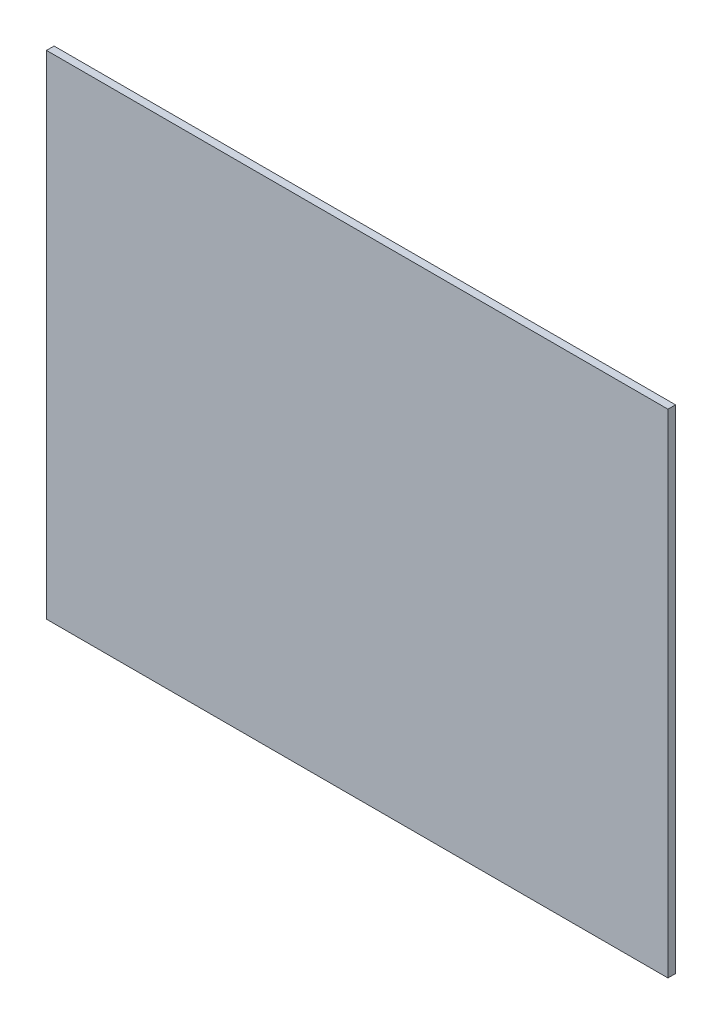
ISO-10303-21;
HEADER;
FILE_DESCRIPTION(('STEP AP214'),'2;1');
FILE_NAME('part.step','',(''),(''),'','','');
FILE_SCHEMA(('AUTOMOTIVE_DESIGN { 1 0 10303 214 1 1 1 1 }'));
ENDSEC;
DATA;
#1=APPLICATION_CONTEXT('core data for automotive mechanical design processes');
#2=APPLICATION_PROTOCOL_DEFINITION('international standard','automotive_design',2000,#1);
#3=PRODUCT_CONTEXT('',#1,'mechanical');
#4=PRODUCT('Part','Part','',(#3));
#5=PRODUCT_RELATED_PRODUCT_CATEGORY('part','',(#4));
#6=PRODUCT_DEFINITION_FORMATION('','',#4);
#7=PRODUCT_DEFINITION_CONTEXT('part definition',#1,'design');
#8=PRODUCT_DEFINITION('design','',#6,#7);
#9=PRODUCT_DEFINITION_SHAPE('','',#8);
#10=(LENGTH_UNIT() NAMED_UNIT(*) SI_UNIT(.MILLI.,.METRE.));
#11=(NAMED_UNIT(*) PLANE_ANGLE_UNIT() SI_UNIT($,.RADIAN.));
#12=(NAMED_UNIT(*) SI_UNIT($,.STERADIAN.) SOLID_ANGLE_UNIT());
#13=UNCERTAINTY_MEASURE_WITH_UNIT(LENGTH_MEASURE(1.E-05),#10,'distance_accuracy_value','');
#14=(GEOMETRIC_REPRESENTATION_CONTEXT(3) GLOBAL_UNCERTAINTY_ASSIGNED_CONTEXT((#13)) GLOBAL_UNIT_ASSIGNED_CONTEXT((#10,
#11,#12)) REPRESENTATION_CONTEXT('',''));
#15=CARTESIAN_POINT('',(0.,0.,0.));
#16=DIRECTION('',(0.,0.,1.));
#17=DIRECTION('',(1.,0.,0.));
#18=AXIS2_PLACEMENT_3D('',#15,#16,#17);
#19=CARTESIAN_POINT('',(520.7,-412.75,6.35));
#20=DIRECTION('',(-1.,0.,0.));
#21=DIRECTION('',(0.,0.,1.));
#22=AXIS2_PLACEMENT_3D('',#19,#20,#21);
#23=PLANE('',#22);
#24=DIRECTION('',(0.,1.,0.));
#25=VECTOR('',#24,1.);
#26=CARTESIAN_POINT('',(520.7,-412.75,-6.35));
#27=LINE('',#26,#25);
#28=CARTESIAN_POINT('',(520.7,-412.75,-6.35));
#29=VERTEX_POINT('',#28);
#30=CARTESIAN_POINT('',(520.7,412.75,-6.35));
#31=VERTEX_POINT('',#30);
#32=EDGE_CURVE('E93',#29,#31,#27,.T.);
#33=ORIENTED_EDGE('',*,*,#32,.T.);
#34=DIRECTION('',(0.,0.,-1.));
#35=VECTOR('',#34,1.);
#36=CARTESIAN_POINT('',(520.7,412.75,6.35));
#37=LINE('',#36,#35);
#38=CARTESIAN_POINT('',(520.7,412.75,6.35));
#39=VERTEX_POINT('',#38);
#40=EDGE_CURVE('E11',#39,#31,#37,.T.);
#41=ORIENTED_EDGE('',*,*,#40,.F.);
#42=DIRECTION('',(0.,1.,0.));
#43=VECTOR('',#42,1.);
#44=CARTESIAN_POINT('',(520.7,-412.75,6.35));
#45=LINE('',#44,#43);
#46=CARTESIAN_POINT('',(520.7,-412.75,6.35));
#47=VERTEX_POINT('',#46);
#48=EDGE_CURVE('E81',#47,#39,#45,.T.);
#49=ORIENTED_EDGE('',*,*,#48,.F.);
#50=DIRECTION('',(0.,0.,-1.));
#51=VECTOR('',#50,1.);
#52=CARTESIAN_POINT('',(520.7,-412.75,6.35));
#53=LINE('',#52,#51);
#54=EDGE_CURVE('E89',#47,#29,#53,.T.);
#55=ORIENTED_EDGE('',*,*,#54,.T.);
#56=EDGE_LOOP('',(#33,#41,#49,#55));
#57=FACE_BOUND('',#56,.T.);
#58=ADVANCED_FACE('F30',(#57),#23,.F.);
#59=CARTESIAN_POINT('',(-520.7,412.75,6.35));
#60=DIRECTION('',(0.,-1.,0.));
#61=DIRECTION('',(0.,0.,-1.));
#62=AXIS2_PLACEMENT_3D('',#59,#60,#61);
#63=PLANE('',#62);
#64=DIRECTION('',(-1.,0.,0.));
#65=VECTOR('',#64,1.);
#66=CARTESIAN_POINT('',(-520.7,412.75,-6.35));
#67=LINE('',#66,#65);
#68=CARTESIAN_POINT('',(-520.7,412.75,-6.35));
#69=VERTEX_POINT('',#68);
#70=EDGE_CURVE('E85',#31,#69,#67,.T.);
#71=ORIENTED_EDGE('',*,*,#70,.T.);
#72=DIRECTION('',(0.,0.,-1.));
#73=VECTOR('',#72,1.);
#74=CARTESIAN_POINT('',(-520.7,412.75,6.35));
#75=LINE('',#74,#73);
#76=CARTESIAN_POINT('',(-520.7,412.75,6.35));
#77=VERTEX_POINT('',#76);
#78=EDGE_CURVE('E38',#77,#69,#75,.T.);
#79=ORIENTED_EDGE('',*,*,#78,.F.);
#80=DIRECTION('',(-1.,0.,0.));
#81=VECTOR('',#80,1.);
#82=CARTESIAN_POINT('',(-520.7,412.75,6.35));
#83=LINE('',#82,#81);
#84=EDGE_CURVE('E76',#39,#77,#83,.T.);
#85=ORIENTED_EDGE('',*,*,#84,.F.);
#86=ORIENTED_EDGE('',*,*,#40,.T.);
#87=EDGE_LOOP('',(#71,#79,#85,#86));
#88=FACE_BOUND('',#87,.T.);
#89=ADVANCED_FACE('F84',(#88),#63,.F.);
#90=CARTESIAN_POINT('',(-520.7,-412.75,6.35));
#91=DIRECTION('',(1.,0.,0.));
#92=DIRECTION('',(0.,0.,-1.));
#93=AXIS2_PLACEMENT_3D('',#90,#91,#92);
#94=PLANE('',#93);
#95=DIRECTION('',(0.,-1.,0.));
#96=VECTOR('',#95,1.);
#97=CARTESIAN_POINT('',(-520.7,-412.75,-6.35));
#98=LINE('',#97,#96);
#99=CARTESIAN_POINT('',(-520.7,-412.75,-6.35));
#100=VERTEX_POINT('',#99);
#101=EDGE_CURVE('E63',#69,#100,#98,.T.);
#102=ORIENTED_EDGE('',*,*,#101,.T.);
#103=DIRECTION('',(0.,0.,-1.));
#104=VECTOR('',#103,1.);
#105=CARTESIAN_POINT('',(-520.7,-412.75,6.35));
#106=LINE('',#105,#104);
#107=CARTESIAN_POINT('',(-520.7,-412.75,6.35));
#108=VERTEX_POINT('',#107);
#109=EDGE_CURVE('E86',#108,#100,#106,.T.);
#110=ORIENTED_EDGE('',*,*,#109,.F.);
#111=DIRECTION('',(0.,-1.,0.));
#112=VECTOR('',#111,1.);
#113=CARTESIAN_POINT('',(-520.7,-412.75,6.35));
#114=LINE('',#113,#112);
#115=EDGE_CURVE('E79',#77,#108,#114,.T.);
#116=ORIENTED_EDGE('',*,*,#115,.F.);
#117=ORIENTED_EDGE('',*,*,#78,.T.);
#118=EDGE_LOOP('',(#102,#110,#116,#117));
#119=FACE_BOUND('',#118,.T.);
#120=ADVANCED_FACE('F87',(#119),#94,.F.);
#121=CARTESIAN_POINT('',(-520.7,-412.75,6.35));
#122=DIRECTION('',(0.,1.,0.));
#123=DIRECTION('',(0.,0.,1.));
#124=AXIS2_PLACEMENT_3D('',#121,#122,#123);
#125=PLANE('',#124);
#126=DIRECTION('',(1.,0.,0.));
#127=VECTOR('',#126,1.);
#128=CARTESIAN_POINT('',(-520.7,-412.75,-6.35));
#129=LINE('',#128,#127);
#130=EDGE_CURVE('E69',#100,#29,#129,.T.);
#131=ORIENTED_EDGE('',*,*,#130,.T.);
#132=ORIENTED_EDGE('',*,*,#54,.F.);
#133=DIRECTION('',(1.,0.,0.));
#134=VECTOR('',#133,1.);
#135=CARTESIAN_POINT('',(-520.7,-412.75,6.35));
#136=LINE('',#135,#134);
#137=EDGE_CURVE('E46',#108,#47,#136,.T.);
#138=ORIENTED_EDGE('',*,*,#137,.F.);
#139=ORIENTED_EDGE('',*,*,#109,.T.);
#140=EDGE_LOOP('',(#131,#132,#138,#139));
#141=FACE_BOUND('',#140,.T.);
#142=ADVANCED_FACE('F100',(#141),#125,.F.);
#143=CARTESIAN_POINT('',(520.7,412.75,6.35));
#144=DIRECTION('',(0.,0.,-1.));
#145=DIRECTION('',(-1.,0.,0.));
#146=AXIS2_PLACEMENT_3D('',#143,#144,#145);
#147=PLANE('',#146);
#148=ORIENTED_EDGE('',*,*,#48,.T.);
#149=ORIENTED_EDGE('',*,*,#84,.T.);
#150=ORIENTED_EDGE('',*,*,#115,.T.);
#151=ORIENTED_EDGE('',*,*,#137,.T.);
#152=EDGE_LOOP('',(#148,#149,#150,#151));
#153=FACE_BOUND('',#152,.T.);
#154=ADVANCED_FACE('F77',(#153),#147,.F.);
#155=CARTESIAN_POINT('',(520.7,412.75,-6.35));
#156=DIRECTION('',(0.,0.,-1.));
#157=DIRECTION('',(-1.,0.,0.));
#158=AXIS2_PLACEMENT_3D('',#155,#156,#157);
#159=PLANE('',#158);
#160=ORIENTED_EDGE('',*,*,#32,.F.);
#161=ORIENTED_EDGE('',*,*,#130,.F.);
#162=ORIENTED_EDGE('',*,*,#101,.F.);
#163=ORIENTED_EDGE('',*,*,#70,.F.);
#164=EDGE_LOOP('',(#160,#161,#162,#163));
#165=FACE_BOUND('',#164,.T.);
#166=ADVANCED_FACE('F103',(#165),#159,.T.);
#167=CLOSED_SHELL('',(#58,#89,#120,#142,#154,#166));
#168=MANIFOLD_SOLID_BREP('B2',#167);
#169=ADVANCED_BREP_SHAPE_REPRESENTATION('',(#18,#168),#14);
#170=SHAPE_DEFINITION_REPRESENTATION(#9,#169);
ENDSEC;
END-ISO-10303-21;
